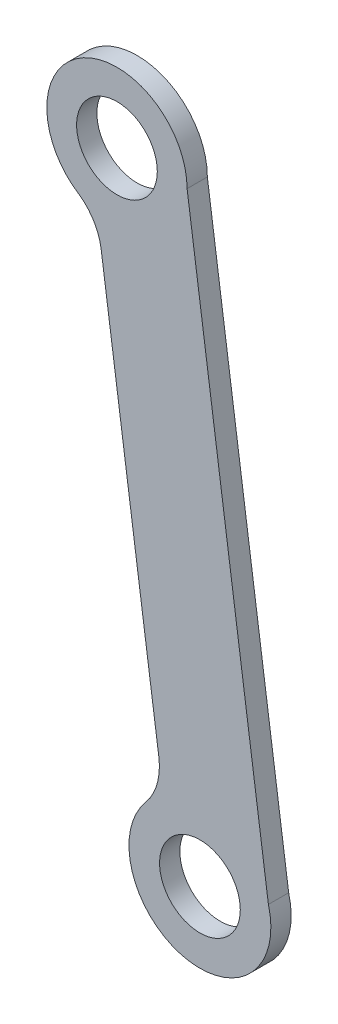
from build123d import *

# Parameters (mm, degrees)
ESQUISSE1_R          = 3.981652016
BASE_EXTRUSION_DEPTH = 2


with BuildPart() as part:
    # Esquisse1 → Base-Extrusion (new body)
    with BuildSketch(Plane.XY):
        with BuildLine():
            Line((349.36189552, 235.982814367), (343.668341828, 276.537703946))
            ThreePointArc((343.668341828, 276.537703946), (342.959714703, 278.526256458), (341.523822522, 280.073740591))
            ThreePointArc((341.523822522, 280.073740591), (341.897682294, 291.980443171), (352.151387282, 285.916544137))
            Line((352.151387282, 285.916544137), (360.174738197, 228.766628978))
            ThreePointArc((360.174738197, 228.766628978), (351.91476756, 220.093952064), (348.053992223, 231.431361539))
            ThreePointArc((348.053992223, 231.431361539), (349.192164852, 233.567942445), (349.36189552, 235.982814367))
        make_face()
        with Locations((353.418094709, 226.93195403)):
            Circle(ESQUISSE1_R, mode=Mode.SUBTRACT)
        with Locations((345.23148186, 285.916544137)):
            Circle(ESQUISSE1_R, mode=Mode.SUBTRACT)
    extrude(amount=-BASE_EXTRUSION_DEPTH)


solid = part.part
